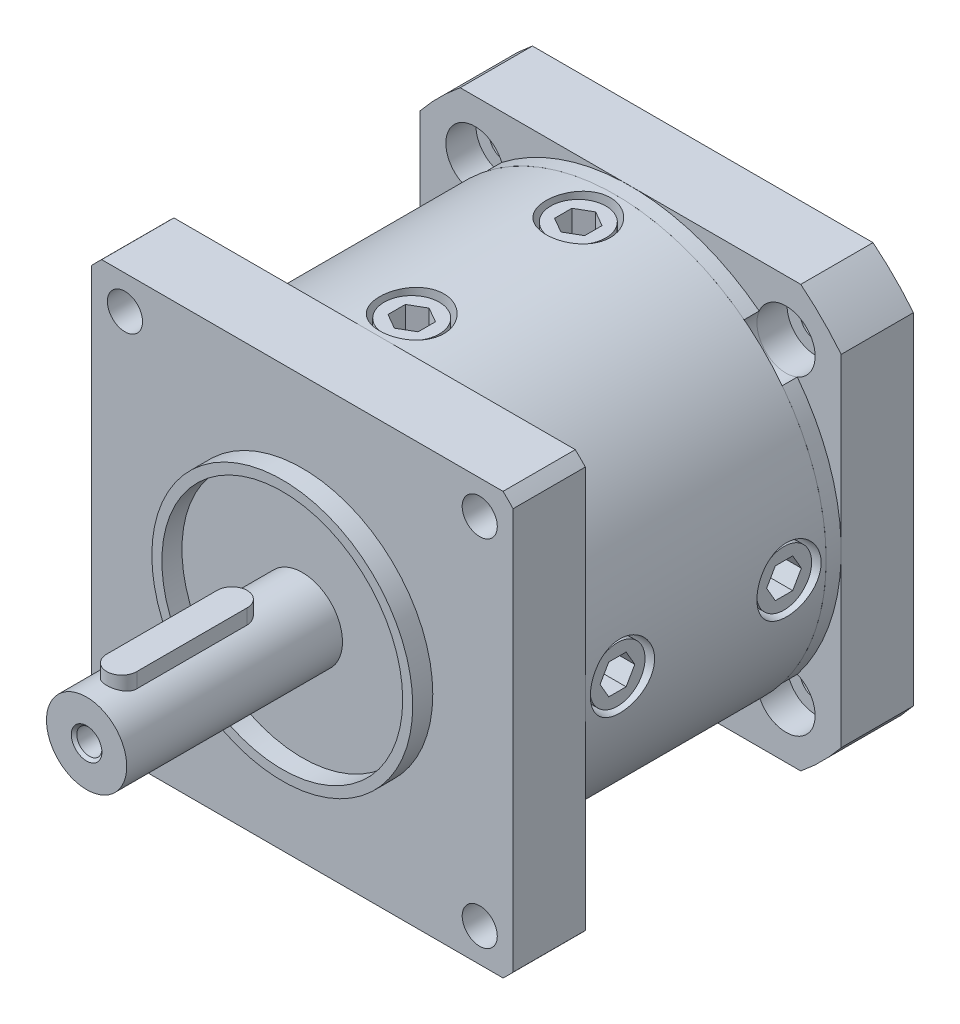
from build123d import *

# Parameters (mm, degrees)
SKETCH_1_R                   = 1.75
EXTRUDE_2_DEPTH              = 7.2
SKETCH_15_R                  = 21
EXTRUDE_8_DEPTH              = 24
SKETCH_17_R                  = 13
SKETCH_17_R_2                = 12
EXTRUDE_9_DEPTH              = 2
SKETCH_18_R                  = 4
EXTRUDE_10_DEPTH             = 21.5
HOLE_WIZARD_M3_1_D           = 2.5
HOLE_WIZARD_M3_1_DEPTH       = 11
HOLE_WIZARD_M3_1_CSINK_D     = 3.05
HOLE_WIZARD_M3_1_CSINK_ANGLE = 90
HOLE_WIZARD_M3_1_TIP         = 0.751075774
EXTRUDE_START                = 2.2
EXTRUDE_11_DEPTH             = 3
SKETCH_25_R                  = 21
EXTRUDE_12_DEPTH             = 1.5
SKETCH_26_R                  = 1.6
EXTRUDE_13_DEPTH             = 7.2
SKETCH_27_R                  = 11
CUT_EXTRUDE_1_DEPTH          = 3
SKETCH_28_R                  = 10
CUT_EXTRUDE_2_DEPTH          = 10
SKETCH_29_R                  = 7.5
EXTRUDE_14_DEPTH             = 8
CUT_EXTRUDE_3_DEPTH          = 7
SKETCH_37_R                  = 2.9
CUT_EXTRUDE_4_DEPTH          = 4.5
SKETCH_38_R                  = 3.2
CUT_EXTRUDE_5_DEPTH          = 3.5
SKETCH_39_R                  = 2.75
EXTRUDE_15_DEPTH             = 3
CUT_EXTRUDE_6_DEPTH          = 3
PATTERN_CIRCULAR_1_COUNT     = 4


with BuildPart() as part:
    # Sketch 1 → Extrude 2 (new body)
    with BuildSketch(Plane.XY):
        with BuildLine():
            Line((-20, -21), (20, -21))
            ThreePointArc((20, -21), (20.506096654, -20.506096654), (21, -20))
            Line((21, -20), (21, 20))
            ThreePointArc((21, 20), (20.506096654, 20.506096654), (20, 21))
            Line((20, 21), (-20, 21))
            ThreePointArc((-20, 21), (-20.506096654, 20.506096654), (-21, 20))
            Line((-21, 20), (-21, -20))
            ThreePointArc((-21, -20), (-20.506096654, -20.506096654), (-20, -21))
        make_face()
        with Locations((-17.67766953, 17.67766953)):
            Circle(SKETCH_1_R, mode=Mode.SUBTRACT)
        with Locations((17.67766953, 17.67766953)):
            Circle(SKETCH_1_R, mode=Mode.SUBTRACT)
        with Locations((17.67766953, -17.67766953)):
            Circle(SKETCH_1_R, mode=Mode.SUBTRACT)
        with Locations((-17.67766953, -17.67766953)):
            Circle(SKETCH_1_R, mode=Mode.SUBTRACT)
    extrude(amount=EXTRUDE_2_DEPTH)

    # Sketch 15 → Extrude 8 (add)
    with BuildSketch(Plane(origin=(0, 0, 0), x_dir=(-1, 0, 0), z_dir=(0, 0, -1))):
        Circle(SKETCH_15_R)
    extrude(amount=EXTRUDE_8_DEPTH)

    # Sketch 17 → Extrude 9 (add)
    with BuildSketch(Plane.XY.offset(7.2)):
        Circle(SKETCH_17_R)
        Circle(SKETCH_17_R_2, mode=Mode.SUBTRACT)
    extrude(amount=EXTRUDE_9_DEPTH)

    # Sketch 18 → Extrude 10 (add)
    with BuildSketch(Plane.XY.offset(7.2)):
        Circle(SKETCH_18_R)
    extrude(amount=EXTRUDE_10_DEPTH)

    # Hole Wizard M3 _1
    with Locations(Plane.XY.offset(28.7)):
        with Locations((0, 0)):
            CounterSinkHole(HOLE_WIZARD_M3_1_D / 2, HOLE_WIZARD_M3_1_CSINK_D / 2, depth=HOLE_WIZARD_M3_1_DEPTH, counter_sink_angle=HOLE_WIZARD_M3_1_CSINK_ANGLE)
            with Locations((0, 0, -(HOLE_WIZARD_M3_1_DEPTH + HOLE_WIZARD_M3_1_TIP / 2))):  # 118° drill point
                Cone(0, HOLE_WIZARD_M3_1_D / 2, HOLE_WIZARD_M3_1_TIP, mode=Mode.SUBTRACT)

    # Sketch 24 → Extrude 11 (add)
    with BuildSketch(Plane(origin=(0, 0, 0), x_dir=(1, 0, 0), z_dir=(0, 1, 0)).offset(EXTRUDE_START)):
        with BuildLine():
            Line((1.5, -14.2), (1.5, -25.2))
            ThreePointArc((1.5, -25.2), (0, -26.7), (-1.5, -25.2))
            Line((-1.5, -25.2), (-1.5, -14.2))
            ThreePointArc((-1.5, -14.2), (0, -12.7), (1.5, -14.2))
        make_face()
    extrude(amount=EXTRUDE_11_DEPTH)


with BuildPart() as body_2:
    # Sketch 25 → Extrude 12 (new body)
    with BuildSketch(Plane(origin=(0, 0, -24), x_dir=(-1, 0, 0), z_dir=(0, 0, -1))):
        Circle(SKETCH_25_R)
    extrude(amount=EXTRUDE_12_DEPTH)


with BuildPart() as body_3:
    # Sketch 26 → Extrude 13 (new body)
    with BuildSketch(Plane(origin=(0, 0, -25.5), x_dir=(-1, 0, 0), z_dir=(0, 0, -1))):
        with BuildLine():
            Line((-16.970562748, 21), (16.970562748, 21))
            ThreePointArc((16.970562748, 21), (19.091883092, 19.091883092), (21, 16.970562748))
            Line((21, 16.970562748), (21, -16.970562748))
            ThreePointArc((21, -16.970562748), (19.091883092, -19.091883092), (16.970562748, -21))
            Line((16.970562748, -21), (-16.970562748, -21))
            ThreePointArc((-16.970562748, -21), (-19.091883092, -19.091883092), (-21, -16.970562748))
            Line((-21, -16.970562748), (-21, 16.970562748))
            ThreePointArc((-21, 16.970562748), (-19.091883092, 19.091883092), (-16.970562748, 21))
        make_face()
        with Locations((-15.5, 15.5)):
            Circle(SKETCH_26_R, mode=Mode.SUBTRACT)
        with Locations((15.5, 15.5)):
            Circle(SKETCH_26_R, mode=Mode.SUBTRACT)
        with Locations((15.5, -15.5)):
            Circle(SKETCH_26_R, mode=Mode.SUBTRACT)
        with Locations((-15.5, -15.5)):
            Circle(SKETCH_26_R, mode=Mode.SUBTRACT)
    extrude(amount=EXTRUDE_13_DEPTH)

    # Sketch 27 → Cut-Extrude 1 (cut)
    with BuildSketch(Plane(origin=(0, 0, -32.7), x_dir=(-1, 0, 0), z_dir=(0, 0, -1))):
        Circle(SKETCH_27_R)
    extrude(amount=-CUT_EXTRUDE_1_DEPTH, mode=Mode.SUBTRACT)


with BuildPart() as cut_extrude_2_tool:
    # Sketch 28 → Cut-Extrude 2 (new body)
    with BuildSketch(Plane(origin=(0, 0, -29.7), x_dir=(-1, 0, 0), z_dir=(0, 0, -1))):
        Circle(SKETCH_28_R)
    extrude(amount=-CUT_EXTRUDE_2_DEPTH)


with BuildPart() as part_1:
    add(part.part)

    # Cut-Extrude 2: cut by cut_extrude_2_tool
    add(cut_extrude_2_tool.part, mode=Mode.SUBTRACT)

    # Sketch 38 → Cut-Extrude 5 (cut)
    with BuildSketch(Plane(origin=(21, 0, 0), x_dir=(0, 0, -1), z_dir=(1, 0, 0))):
        with Locations((3.7, 0)):
            Circle(SKETCH_38_R)
        with Locations((20.3, 0)):
            Circle(SKETCH_38_R)
    cut_extrude_5 = extrude(amount=-CUT_EXTRUDE_5_DEPTH, mode=Mode.SUBTRACT)

    # Sketch 39 → Extrude 15 (add)
    with BuildSketch(Plane(origin=(17.5, 0, 0), x_dir=(0, 0, -1), z_dir=(1, 0, 0))):
        with Locations((3.7, 0)):
            Circle(SKETCH_39_R)
        with Locations((20.3, 0)):
            Circle(SKETCH_39_R)
    extrude_15 = extrude(amount=EXTRUDE_15_DEPTH)

    # Sketch 40 → Cut-Extrude 6 (cut)
    with BuildSketch(Plane(origin=(20.5, 0, 0), x_dir=(0, 0, -1), z_dir=(1, 0, 0))):
        Polygon((5.432050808, 0), (4.566025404, 1.5), (2.833974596, 1.5), (1.967949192, 0), (2.833974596, -1.5), (4.566025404, -1.5), align=None)
        Polygon((22.032050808, 0), (21.166025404, 1.5), (19.433974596, 1.5), (18.567949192, 0), (19.433974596, -1.5), (21.166025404, -1.5), align=None)
    cut_extrude_6 = extrude(amount=-CUT_EXTRUDE_6_DEPTH, mode=Mode.SUBTRACT)

    # Pattern Circular 1: Cut-Extrude 5, Extrude 15, Cut-Extrude 6 ×4 about axis
    pattern_circular_1_axis = Axis((0, 0, 0), (0, 0, 1))
    add([cut_extrude_5.rotate(pattern_circular_1_axis, i * 360 / PATTERN_CIRCULAR_1_COUNT) for i in range(1, PATTERN_CIRCULAR_1_COUNT)], mode=Mode.SUBTRACT)
    add([extrude_15.rotate(pattern_circular_1_axis, i * 360 / PATTERN_CIRCULAR_1_COUNT) for i in range(1, PATTERN_CIRCULAR_1_COUNT)])
    add([cut_extrude_6.rotate(pattern_circular_1_axis, i * 360 / PATTERN_CIRCULAR_1_COUNT) for i in range(1, PATTERN_CIRCULAR_1_COUNT)], mode=Mode.SUBTRACT)


with BuildPart() as body_2_1:
    add(body_2.part)

    # Cut-Extrude 2: cut by cut_extrude_2_tool
    add(cut_extrude_2_tool.part, mode=Mode.SUBTRACT)


with BuildPart() as body_3_1:
    add(body_3.part)

    # Cut-Extrude 2: cut by cut_extrude_2_tool
    add(cut_extrude_2_tool.part, mode=Mode.SUBTRACT)


with BuildPart() as body_4:
    # Sketch 29 → Extrude 14 (new body)
    with BuildSketch(Plane(origin=(0, 0, -19.7), x_dir=(-1, 0, 0), z_dir=(0, 0, -1))):
        Circle(SKETCH_29_R)
    extrude(amount=EXTRUDE_14_DEPTH)

    # Sketch 30 → Cut-Extrude 3 (cut)
    with BuildSketch(Plane(origin=(0, 0, -27.7), x_dir=(-1, 0, 0), z_dir=(0, 0, -1))):
        with BuildLine():
            Line((-1.5, 2), (1.5, 2))
            ThreePointArc((1.5, 2), (0, -2.5), (-1.5, 2))
        make_face()
    extrude(amount=-CUT_EXTRUDE_3_DEPTH, mode=Mode.SUBTRACT)


with BuildPart() as hole_wizard_m3_2_tool:
    # Sketch 33 → Hole Wizard M3 _2 (revolve)
    with BuildSketch(Plane(origin=(0, 2, -25.255666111), x_dir=(0, 0, -1), z_dir=(1, 0, 0))):
        Polygon((0, 0), (0, 8.251075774), (1.25, 7.5), (1.25, 0), align=None)
    revolve(axis=Axis((0, -4.35, -25.255666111), (0, 1, 0)))


with BuildPart() as body_2_2:
    add(body_2_1.part)

    # Hole Wizard M3 _2: cut by hole_wizard_m3_2_tool
    add(hole_wizard_m3_2_tool.part, mode=Mode.SUBTRACT)


with BuildPart() as body_3_2:
    add(body_3_1.part)

    # Hole Wizard M3 _2: cut by hole_wizard_m3_2_tool
    add(hole_wizard_m3_2_tool.part, mode=Mode.SUBTRACT)


with BuildPart() as body_4_1:
    add(body_4.part)

    # Hole Wizard M3 _2: cut by hole_wizard_m3_2_tool
    add(hole_wizard_m3_2_tool.part, mode=Mode.SUBTRACT)


with BuildPart() as cut_extrude_4_tool:
    # Sketch 37 → Cut-Extrude 4 (new body)
    with BuildSketch(Plane.XY.offset(-24)):
        with Locations((15.5, 15.5)):
            Circle(SKETCH_37_R)
        with Locations((15.5, -15.5)):
            Circle(SKETCH_37_R)
        with Locations((-15.5, -15.5)):
            Circle(SKETCH_37_R)
        with Locations((-15.5, 15.5)):
            Circle(SKETCH_37_R)
    extrude(amount=-CUT_EXTRUDE_4_DEPTH)


with BuildPart() as body_2_3:
    add(body_2_2.part)

    # Cut-Extrude 4: cut by cut_extrude_4_tool
    add(cut_extrude_4_tool.part, mode=Mode.SUBTRACT)


with BuildPart() as body_3_3:
    add(body_3_2.part)

    # Cut-Extrude 4: cut by cut_extrude_4_tool
    add(cut_extrude_4_tool.part, mode=Mode.SUBTRACT)


solid = Compound([part_1.part, body_4_1.part, body_2_3.part, body_3_3.part])
